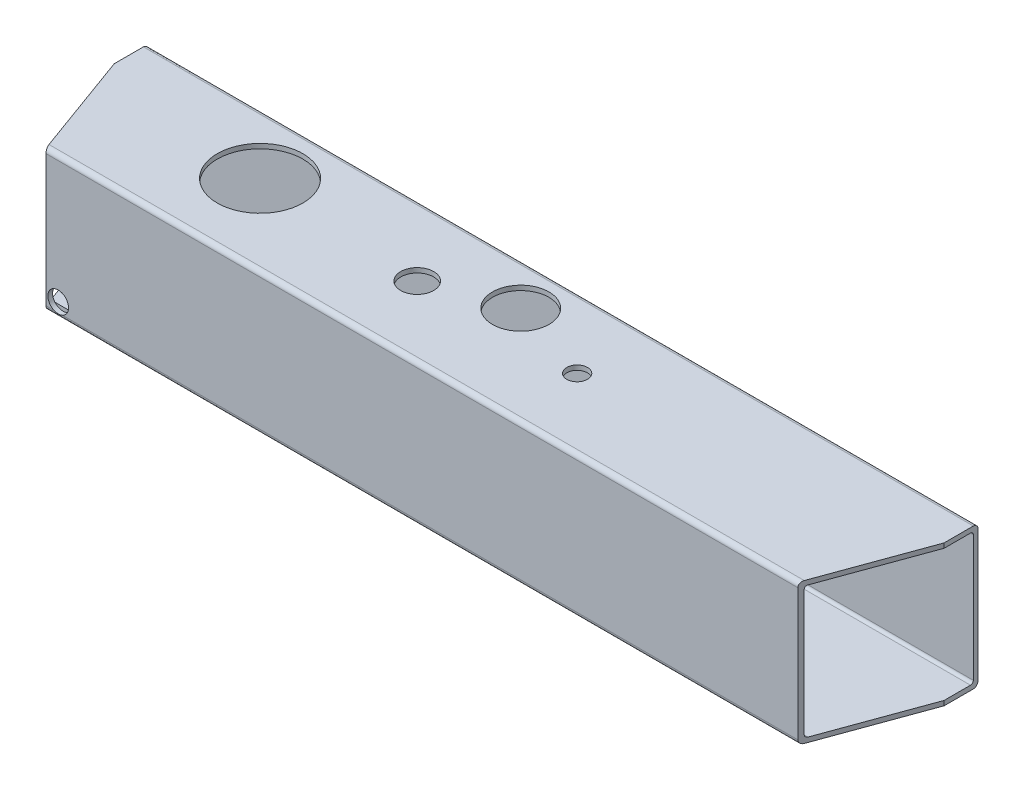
ISO-10303-21;
HEADER;
FILE_DESCRIPTION(('STEP AP214'),'2;1');
FILE_NAME('part.step','',(''),(''),'','','');
FILE_SCHEMA(('AUTOMOTIVE_DESIGN { 1 0 10303 214 1 1 1 1 }'));
ENDSEC;
DATA;
#1=APPLICATION_CONTEXT('core data for automotive mechanical design processes');
#2=APPLICATION_PROTOCOL_DEFINITION('international standard','automotive_design',2000,#1);
#3=PRODUCT_CONTEXT('',#1,'mechanical');
#4=PRODUCT('Part','Part','',(#3));
#5=PRODUCT_RELATED_PRODUCT_CATEGORY('part','',(#4));
#6=PRODUCT_DEFINITION_FORMATION('','',#4);
#7=PRODUCT_DEFINITION_CONTEXT('part definition',#1,'design');
#8=PRODUCT_DEFINITION('design','',#6,#7);
#9=PRODUCT_DEFINITION_SHAPE('','',#8);
#10=(LENGTH_UNIT() NAMED_UNIT(*) SI_UNIT(.MILLI.,.METRE.));
#11=(NAMED_UNIT(*) PLANE_ANGLE_UNIT() SI_UNIT($,.RADIAN.));
#12=(NAMED_UNIT(*) SI_UNIT($,.STERADIAN.) SOLID_ANGLE_UNIT());
#13=UNCERTAINTY_MEASURE_WITH_UNIT(LENGTH_MEASURE(1.E-05),#10,'distance_accuracy_value','');
#14=(GEOMETRIC_REPRESENTATION_CONTEXT(3) GLOBAL_UNCERTAINTY_ASSIGNED_CONTEXT((#13)) GLOBAL_UNIT_ASSIGNED_CONTEXT((#10,
#11,#12)) REPRESENTATION_CONTEXT('',''));
#15=CARTESIAN_POINT('',(0.,0.,0.));
#16=DIRECTION('',(0.,0.,1.));
#17=DIRECTION('',(1.,0.,0.));
#18=AXIS2_PLACEMENT_3D('',#15,#16,#17);
#19=CARTESIAN_POINT('',(441.,-67.,7.99999999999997));
#20=DIRECTION('',(-1.,0.,0.));
#21=DIRECTION('',(0.,0.,1.));
#22=AXIS2_PLACEMENT_3D('',#19,#20,#21);
#23=CYLINDRICAL_SURFACE('',#22,3.);
#24=CARTESIAN_POINT('',(15.1986841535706,-70.,7.99999999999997));
#25=CARTESIAN_POINT('',(14.9643266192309,-69.9999652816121,7.90372846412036));
#26=CARTESIAN_POINT('',(14.7290875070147,-69.9953674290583,7.80970354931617));
#27=CARTESIAN_POINT('',(14.2571828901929,-69.9780619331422,7.62625599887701));
#28=CARTESIAN_POINT('',(14.0205177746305,-69.9653564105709,7.53683216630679));
#29=CARTESIAN_POINT('',(13.5462759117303,-69.9328715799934,7.36275581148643));
#30=CARTESIAN_POINT('',(13.3087007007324,-69.9131012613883,7.27809738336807));
#31=CARTESIAN_POINT('',(12.832526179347,-69.8672896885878,7.11346223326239));
#32=CARTESIAN_POINT('',(12.5939267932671,-69.841247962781,7.03348586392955));
#33=CARTESIAN_POINT('',(11.878106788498,-69.7549529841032,6.80102319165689));
#34=CARTESIAN_POINT('',(11.3995845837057,-69.6864343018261,6.65553406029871));
#35=CARTESIAN_POINT('',(10.4399178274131,-69.5318907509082,6.38320208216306));
#36=CARTESIAN_POINT('',(9.95877220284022,-69.4458580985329,6.2563675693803));
#37=CARTESIAN_POINT('',(9.08628068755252,-69.2775499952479,6.043601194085));
#38=CARTESIAN_POINT('',(8.69524447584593,-69.1976671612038,5.95447673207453));
#39=CARTESIAN_POINT('',(7.91221594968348,-69.0303453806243,5.78830469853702));
#40=CARTESIAN_POINT('',(7.52022357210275,-68.9429059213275,5.7112579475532));
#41=CARTESIAN_POINT('',(6.34300548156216,-68.6713367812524,5.49807034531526));
#42=CARTESIAN_POINT('',(5.55658730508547,-68.4779660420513,5.37989393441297));
#43=CARTESIAN_POINT('',(3.98184487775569,-68.0759302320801,5.19077702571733));
#44=CARTESIAN_POINT('',(3.19352002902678,-67.8672595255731,5.1198540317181));
#45=CARTESIAN_POINT('',(1.61626316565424,-67.4425795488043,5.02486445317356));
#46=CARTESIAN_POINT('',(0.827331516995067,-67.2265732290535,5.00077925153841));
#47=CARTESIAN_POINT('',(0.025719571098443,-67.0070435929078,5.00000620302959));
#48=CARTESIAN_POINT('',(0.0128597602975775,-67.0035217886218,5.00000000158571));
#49=CARTESIAN_POINT('',(0.,-67.,4.99999999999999));
#50=B_SPLINE_CURVE_WITH_KNOTS('',3,(#24,#25,#26,#27,#28,#29,#30,#31,#32,#33,#34,#35,#36,#37,#38,
#39,#40,#41,#42,#43,#44,#45,#46,#47,#48,#49),.UNSPECIFIED.,.F.,.F.,(4,2,2,2,2,2,2,2,2,2,2,2,4),
(0.,0.759974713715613,1.51975071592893,2.27856338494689,3.03743313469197,4.55107995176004,
6.06540095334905,7.29196399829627,8.5186103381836,10.9720552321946,13.4264084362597,
15.8797858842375,15.9197858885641),.UNSPECIFIED.);
#51=CARTESIAN_POINT('',(0.,-67.,4.99999999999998));
#52=VERTEX_POINT('',#51);
#53=CARTESIAN_POINT('',(15.1986841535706,-70.,7.99999999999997));
#54=VERTEX_POINT('',#53);
#55=EDGE_CURVE('E63',#52,#54,#50,.F.);
#56=ORIENTED_EDGE('',*,*,#55,.T.);
#57=DIRECTION('',(-1.,0.,0.));
#58=VECTOR('',#57,1.);
#59=CARTESIAN_POINT('',(441.,-70.,7.99999999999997));
#60=LINE('',#59,#58);
#61=CARTESIAN_POINT('',(441.,-70.,7.99999999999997));
#62=VERTEX_POINT('',#61);
#63=EDGE_CURVE('E215',#62,#54,#60,.T.);
#64=ORIENTED_EDGE('',*,*,#63,.F.);
#65=CARTESIAN_POINT('',(441.,-67.,7.99999999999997));
#66=DIRECTION('',(1.,0.,0.));
#67=DIRECTION('',(0.,0.,-1.));
#68=AXIS2_PLACEMENT_3D('',#65,#66,#67);
#69=CIRCLE('',#68,3.);
#70=CARTESIAN_POINT('',(441.,-67.,4.99999999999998));
#71=VERTEX_POINT('',#70);
#72=EDGE_CURVE('E273',#62,#71,#69,.T.);
#73=ORIENTED_EDGE('',*,*,#72,.T.);
#74=DIRECTION('',(-1.,0.,0.));
#75=VECTOR('',#74,1.);
#76=CARTESIAN_POINT('',(441.,-67.,4.99999999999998));
#77=LINE('',#76,#75);
#78=EDGE_CURVE('E229',#71,#52,#77,.T.);
#79=ORIENTED_EDGE('',*,*,#78,.T.);
#80=EDGE_LOOP('',(#56,#64,#73,#79));
#81=FACE_BOUND('',#80,.T.);
#82=ADVANCED_FACE('F43',(#81),#23,.F.);
#83=CARTESIAN_POINT('',(441.,75.,145.));
#84=DIRECTION('',(0.,-1.,0.));
#85=DIRECTION('',(0.,0.,-1.));
#86=AXIS2_PLACEMENT_3D('',#83,#84,#85);
#87=PLANE('',#86);
#88=CARTESIAN_POINT('',(-258.,75.,64.));
#89=DIRECTION('',(0.,1.,0.));
#90=DIRECTION('',(0.,0.,1.));
#91=AXIS2_PLACEMENT_3D('',#88,#89,#90);
#92=CIRCLE('',#91,45.5);
#93=CARTESIAN_POINT('',(-258.,75.,109.5));
#94=VERTEX_POINT('',#93);
#95=EDGE_CURVE('E545',#94,#94,#92,.T.);
#96=ORIENTED_EDGE('',*,*,#95,.F.);
#97=EDGE_LOOP('',(#96));
#98=FACE_BOUND('',#97,.T.);
#99=CARTESIAN_POINT('',(-80.,75.,75.));
#100=DIRECTION('',(0.,1.,0.));
#101=DIRECTION('',(0.,0.,1.));
#102=AXIS2_PLACEMENT_3D('',#99,#100,#101);
#103=CIRCLE('',#102,17.5);
#104=CARTESIAN_POINT('',(-80.,75.,92.5));
#105=VERTEX_POINT('',#104);
#106=EDGE_CURVE('E541',#105,#105,#103,.T.);
#107=ORIENTED_EDGE('',*,*,#106,.F.);
#108=EDGE_LOOP('',(#107));
#109=FACE_BOUND('',#108,.T.);
#110=CARTESIAN_POINT('',(0.,75.,45.));
#111=DIRECTION('',(0.,1.,0.));
#112=DIRECTION('',(0.,0.,1.));
#113=AXIS2_PLACEMENT_3D('',#110,#111,#112);
#114=CIRCLE('',#113,30.);
#115=CARTESIAN_POINT('',(0.,75.,75.));
#116=VERTEX_POINT('',#115);
#117=EDGE_CURVE('E535',#116,#116,#114,.T.);
#118=ORIENTED_EDGE('',*,*,#117,.F.);
#119=EDGE_LOOP('',(#118));
#120=FACE_BOUND('',#119,.T.);
#121=DIRECTION('',(0.342020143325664,0.,-0.93969262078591));
#122=VECTOR('',#121,1.);
#123=CARTESIAN_POINT('',(441.,75.,36.));
#124=LINE('',#123,#122);
#125=CARTESIAN_POINT('',(401.327244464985,75.,145.));
#126=VERTEX_POINT('',#125);
#127=CARTESIAN_POINT('',(441.,75.,36.));
#128=VERTEX_POINT('',#127);
#129=EDGE_CURVE('E420',#126,#128,#124,.T.);
#130=ORIENTED_EDGE('',*,*,#129,.T.);
#131=DIRECTION('',(0.,0.,1.));
#132=VECTOR('',#131,1.);
#133=CARTESIAN_POINT('',(441.,75.,145.));
#134=LINE('',#133,#132);
#135=CARTESIAN_POINT('',(441.,75.,4.99999999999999));
#136=VERTEX_POINT('',#135);
#137=EDGE_CURVE('E252',#136,#128,#134,.T.);
#138=ORIENTED_EDGE('',*,*,#137,.F.);
#139=DIRECTION('',(-1.,0.,0.));
#140=VECTOR('',#139,1.);
#141=CARTESIAN_POINT('',(441.,75.,4.99999999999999));
#142=LINE('',#141,#140);
#143=CARTESIAN_POINT('',(-441.,75.,4.99999999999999));
#144=VERTEX_POINT('',#143);
#145=EDGE_CURVE('E289',#136,#144,#142,.T.);
#146=ORIENTED_EDGE('',*,*,#145,.T.);
#147=DIRECTION('',(0.,0.,1.));
#148=VECTOR('',#147,1.);
#149=CARTESIAN_POINT('',(-441.,75.,145.));
#150=LINE('',#149,#148);
#151=CARTESIAN_POINT('',(-441.,75.,36.));
#152=VERTEX_POINT('',#151);
#153=EDGE_CURVE('E262',#144,#152,#150,.T.);
#154=ORIENTED_EDGE('',*,*,#153,.T.);
#155=DIRECTION('',(-0.342020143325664,0.,-0.93969262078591));
#156=VECTOR('',#155,1.);
#157=CARTESIAN_POINT('',(-441.,75.,36.));
#158=LINE('',#157,#156);
#159=CARTESIAN_POINT('',(-401.327244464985,75.,145.));
#160=VERTEX_POINT('',#159);
#161=EDGE_CURVE('E389',#160,#152,#158,.T.);
#162=ORIENTED_EDGE('',*,*,#161,.F.);
#163=DIRECTION('',(-1.,0.,0.));
#164=VECTOR('',#163,1.);
#165=CARTESIAN_POINT('',(441.,75.,145.));
#166=LINE('',#165,#164);
#167=EDGE_CURVE('E238',#126,#160,#166,.T.);
#168=ORIENTED_EDGE('',*,*,#167,.F.);
#169=EDGE_LOOP('',(#130,#138,#146,#154,#162,#168));
#170=FACE_BOUND('',#169,.T.);
#171=CARTESIAN_POINT('',(90.,75.,75.));
#172=DIRECTION('',(0.,1.,0.));
#173=DIRECTION('',(0.,0.,1.));
#174=AXIS2_PLACEMENT_3D('',#171,#172,#173);
#175=CIRCLE('',#174,11.);
#176=CARTESIAN_POINT('',(90.,75.,86.));
#177=VERTEX_POINT('',#176);
#178=EDGE_CURVE('E532',#177,#177,#175,.T.);
#179=ORIENTED_EDGE('',*,*,#178,.F.);
#180=EDGE_LOOP('',(#179));
#181=FACE_BOUND('',#180,.T.);
#182=ADVANCED_FACE('F382',(#98,#109,#120,#170,#181),#87,.F.);
#183=CARTESIAN_POINT('',(441.,70.,150.));
#184=DIRECTION('',(0.,0.,-1.));
#185=DIRECTION('',(0.,1.,0.));
#186=AXIS2_PLACEMENT_3D('',#183,#184,#185);
#187=PLANE('',#186);
#188=CARTESIAN_POINT('',(-386.507393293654,-60.,150.));
#189=DIRECTION('',(0.,0.,1.));
#190=DIRECTION('',(0.,-1.,0.));
#191=AXIS2_PLACEMENT_3D('',#188,#189,#190);
#192=CIRCLE('',#191,11.);
#193=CARTESIAN_POINT('',(-381.924817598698,-70.,150.));
#194=VERTEX_POINT('',#193);
#195=CARTESIAN_POINT('',(-391.089968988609,-70.,150.));
#196=VERTEX_POINT('',#195);
#197=EDGE_CURVE('E401',#194,#196,#192,.T.);
#198=ORIENTED_EDGE('',*,*,#197,.F.);
#199=DIRECTION('',(-1.,0.,0.));
#200=VECTOR('',#199,1.);
#201=CARTESIAN_POINT('',(441.,-70.,150.));
#202=LINE('',#201,#200);
#203=CARTESIAN_POINT('',(399.507393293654,-70.,150.));
#204=VERTEX_POINT('',#203);
#205=EDGE_CURVE('E305',#204,#194,#202,.T.);
#206=ORIENTED_EDGE('',*,*,#205,.F.);
#207=DIRECTION('',(0.,1.,0.));
#208=VECTOR('',#207,1.);
#209=CARTESIAN_POINT('',(399.507393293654,-75.0000000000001,150.));
#210=LINE('',#209,#208);
#211=CARTESIAN_POINT('',(399.507393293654,70.,150.));
#212=VERTEX_POINT('',#211);
#213=EDGE_CURVE('E395',#204,#212,#210,.T.);
#214=ORIENTED_EDGE('',*,*,#213,.T.);
#215=DIRECTION('',(-1.,0.,0.));
#216=VECTOR('',#215,1.);
#217=CARTESIAN_POINT('',(441.,70.,150.));
#218=LINE('',#217,#216);
#219=CARTESIAN_POINT('',(-399.507393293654,70.,150.));
#220=VERTEX_POINT('',#219);
#221=EDGE_CURVE('E241',#212,#220,#218,.T.);
#222=ORIENTED_EDGE('',*,*,#221,.T.);
#223=DIRECTION('',(0.,1.,0.));
#224=VECTOR('',#223,1.);
#225=CARTESIAN_POINT('',(-399.507393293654,-75.0000000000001,150.));
#226=LINE('',#225,#224);
#227=CARTESIAN_POINT('',(-399.507393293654,-70.,150.));
#228=VERTEX_POINT('',#227);
#229=EDGE_CURVE('E425',#228,#220,#226,.T.);
#230=ORIENTED_EDGE('',*,*,#229,.F.);
#231=EDGE_CURVE('E304',#196,#228,#202,.T.);
#232=ORIENTED_EDGE('',*,*,#231,.F.);
#233=EDGE_LOOP('',(#198,#206,#214,#222,#230,#232));
#234=FACE_BOUND('',#233,.T.);
#235=ADVANCED_FACE('F423',(#234),#187,.F.);
#236=CARTESIAN_POINT('',(441.,70.,145.));
#237=DIRECTION('',(-1.,0.,0.));
#238=DIRECTION('',(0.,0.,1.));
#239=AXIS2_PLACEMENT_3D('',#236,#237,#238);
#240=CYLINDRICAL_SURFACE('',#239,5.);
#241=CARTESIAN_POINT('',(401.327244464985,70.,145.));
#242=DIRECTION('',(0.93969262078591,0.,0.342020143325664));
#243=DIRECTION('',(-0.342020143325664,0.,0.93969262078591));
#244=AXIS2_PLACEMENT_3D('',#241,#242,#243);
#245=ELLIPSE('',#244,5.32088886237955,5.);
#246=EDGE_CURVE('E435',#126,#212,#245,.T.);
#247=ORIENTED_EDGE('',*,*,#246,.F.);
#248=ORIENTED_EDGE('',*,*,#167,.T.);
#249=CARTESIAN_POINT('',(-401.327244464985,70.,145.));
#250=DIRECTION('',(0.93969262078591,0.,-0.342020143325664));
#251=DIRECTION('',(-0.342020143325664,0.,-0.93969262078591));
#252=AXIS2_PLACEMENT_3D('',#249,#250,#251);
#253=ELLIPSE('',#252,5.32088886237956,5.);
#254=EDGE_CURVE('E351',#160,#220,#253,.T.);
#255=ORIENTED_EDGE('',*,*,#254,.T.);
#256=ORIENTED_EDGE('',*,*,#221,.F.);
#257=EDGE_LOOP('',(#247,#248,#255,#256));
#258=FACE_BOUND('',#257,.T.);
#259=ADVANCED_FACE('F492',(#258),#240,.T.);
#260=CARTESIAN_POINT('',(441.,-70.,145.));
#261=DIRECTION('',(-1.,0.,0.));
#262=DIRECTION('',(0.,0.,1.));
#263=AXIS2_PLACEMENT_3D('',#260,#261,#262);
#264=CYLINDRICAL_SURFACE('',#263,4.99999999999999);
#265=ORIENTED_EDGE('',*,*,#205,.T.);
#266=CARTESIAN_POINT('',(-381.924817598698,-70.,150.));
#267=CARTESIAN_POINT('',(-382.063832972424,-70.0637070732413,149.999990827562));
#268=CARTESIAN_POINT('',(-382.204169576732,-70.1245076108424,149.998782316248));
#269=CARTESIAN_POINT('',(-382.487221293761,-70.2401942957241,149.994565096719));
#270=CARTESIAN_POINT('',(-382.629936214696,-70.2950809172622,149.991556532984));
#271=CARTESIAN_POINT('',(-382.917493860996,-70.3988454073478,149.984337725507));
#272=CARTESIAN_POINT('',(-383.062336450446,-70.4477236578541,149.980127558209));
#273=CARTESIAN_POINT('',(-383.353905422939,-70.5393963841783,149.97103287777));
#274=CARTESIAN_POINT('',(-383.50063184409,-70.5821907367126,149.966148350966));
#275=CARTESIAN_POINT('',(-383.943045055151,-70.7012760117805,149.951228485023));
#276=CARTESIAN_POINT('',(-384.241256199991,-70.7683738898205,149.940917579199));
#277=CARTESIAN_POINT('',(-384.842249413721,-70.8775271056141,149.922702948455));
#278=CARTESIAN_POINT('',(-385.145031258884,-70.9195836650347,149.914799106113));
#279=CARTESIAN_POINT('',(-385.755442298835,-70.9785825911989,149.903396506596));
#280=CARTESIAN_POINT('',(-386.063090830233,-70.9953330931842,149.899931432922));
#281=CARTESIAN_POINT('',(-386.678744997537,-71.0029736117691,149.89837302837));
#282=CARTESIAN_POINT('',(-386.986750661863,-70.9938614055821,149.90028015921));
#283=CARTESIAN_POINT('',(-387.600531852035,-70.9498679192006,149.908996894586));
#284=CARTESIAN_POINT('',(-387.906309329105,-70.9150128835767,149.915801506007));
#285=CARTESIAN_POINT('',(-388.513673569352,-70.8198585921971,149.932559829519));
#286=CARTESIAN_POINT('',(-388.815261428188,-70.7595661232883,149.94251270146));
#287=CARTESIAN_POINT('',(-389.453215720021,-70.6039654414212,149.964095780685));
#288=CARTESIAN_POINT('',(-389.788702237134,-70.5049978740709,149.975769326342));
#289=CARTESIAN_POINT('',(-390.283496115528,-70.3330309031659,149.98922406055));
#290=CARTESIAN_POINT('',(-390.446935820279,-70.271828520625,149.99303208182));
#291=CARTESIAN_POINT('',(-390.770805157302,-70.1416851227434,149.99841458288));
#292=CARTESIAN_POINT('',(-390.931233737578,-70.0727414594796,149.999988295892));
#293=CARTESIAN_POINT('',(-391.089968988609,-70.,150.));
#294=B_SPLINE_CURVE_WITH_KNOTS('',3,(#266,#267,#268,#269,#270,#271,#272,#273,#274,#275,#276,
#277,#278,#279,#280,#281,#282,#283,#284,#285,#286,#287,#288,#289,#290,#291,#292,#293),
.UNSPECIFIED.,.F.,.F.,(4,2,2,2,2,2,2,2,2,2,2,2,2,4),(0.,0.458701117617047,0.917365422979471,
1.37600055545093,1.83464498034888,2.75101013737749,3.66733058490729,4.59056410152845,
5.51387696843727,6.43624982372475,7.35837674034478,8.40652760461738,8.93004043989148,
9.45373289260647),.UNSPECIFIED.);
#295=EDGE_CURVE('E411',#194,#196,#294,.T.);
#296=ORIENTED_EDGE('',*,*,#295,.T.);
#297=ORIENTED_EDGE('',*,*,#231,.T.);
#298=CARTESIAN_POINT('',(-401.327244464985,-70.,145.));
#299=DIRECTION('',(0.93969262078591,0.,-0.342020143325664));
#300=DIRECTION('',(-0.342020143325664,0.,-0.93969262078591));
#301=AXIS2_PLACEMENT_3D('',#298,#299,#300);
#302=ELLIPSE('',#301,5.32088886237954,4.99999999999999);
#303=CARTESIAN_POINT('',(-401.327244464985,-75.0000000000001,145.));
#304=VERTEX_POINT('',#303);
#305=EDGE_CURVE('E348',#228,#304,#302,.T.);
#306=ORIENTED_EDGE('',*,*,#305,.T.);
#307=DIRECTION('',(-1.,0.,0.));
#308=VECTOR('',#307,1.);
#309=CARTESIAN_POINT('',(441.,-75.,145.));
#310=LINE('',#309,#308);
#311=CARTESIAN_POINT('',(401.327244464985,-75.0000000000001,145.));
#312=VERTEX_POINT('',#311);
#313=EDGE_CURVE('E302',#312,#304,#310,.T.);
#314=ORIENTED_EDGE('',*,*,#313,.F.);
#315=CARTESIAN_POINT('',(401.327244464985,-70.,145.));
#316=DIRECTION('',(0.93969262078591,0.,0.342020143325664));
#317=DIRECTION('',(-0.342020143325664,0.,0.93969262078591));
#318=AXIS2_PLACEMENT_3D('',#315,#316,#317);
#319=ELLIPSE('',#318,5.32088886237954,4.99999999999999);
#320=EDGE_CURVE('E437',#204,#312,#319,.T.);
#321=ORIENTED_EDGE('',*,*,#320,.F.);
#322=EDGE_LOOP('',(#265,#296,#297,#306,#314,#321));
#323=FACE_BOUND('',#322,.T.);
#324=ADVANCED_FACE('F417',(#323),#264,.T.);
#325=CARTESIAN_POINT('',(441.,-75.,145.));
#326=DIRECTION('',(0.,1.,0.));
#327=DIRECTION('',(0.,0.,1.));
#328=AXIS2_PLACEMENT_3D('',#325,#326,#327);
#329=PLANE('',#328);
#330=DIRECTION('',(-1.,0.,0.));
#331=VECTOR('',#330,1.);
#332=CARTESIAN_POINT('',(441.,-75.,4.99999999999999));
#333=LINE('',#332,#331);
#334=CARTESIAN_POINT('',(0.,-75.,4.99999999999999));
#335=VERTEX_POINT('',#334);
#336=CARTESIAN_POINT('',(-441.,-75.,4.99999999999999));
#337=VERTEX_POINT('',#336);
#338=EDGE_CURVE('E298',#335,#337,#333,.T.);
#339=ORIENTED_EDGE('',*,*,#338,.F.);
#340=CARTESIAN_POINT('',(0.,-75.,45.));
#341=DIRECTION('',(0.,-1.,0.));
#342=DIRECTION('',(0.,0.,-1.));
#343=AXIS2_PLACEMENT_3D('',#340,#341,#342);
#344=CIRCLE('',#343,40.);
#345=EDGE_CURVE('E56',#335,#335,#344,.T.);
#346=ORIENTED_EDGE('',*,*,#345,.F.);
#347=CARTESIAN_POINT('',(441.,-75.,4.99999999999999));
#348=VERTEX_POINT('',#347);
#349=EDGE_CURVE('E299',#348,#335,#333,.T.);
#350=ORIENTED_EDGE('',*,*,#349,.F.);
#351=DIRECTION('',(0.,0.,-1.));
#352=VECTOR('',#351,1.);
#353=CARTESIAN_POINT('',(441.,-75.,145.));
#354=LINE('',#353,#352);
#355=CARTESIAN_POINT('',(441.,-75.,36.));
#356=VERTEX_POINT('',#355);
#357=EDGE_CURVE('E278',#356,#348,#354,.T.);
#358=ORIENTED_EDGE('',*,*,#357,.F.);
#359=DIRECTION('',(0.342020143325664,0.,-0.93969262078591));
#360=VECTOR('',#359,1.);
#361=CARTESIAN_POINT('',(441.,-75.0000000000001,36.));
#362=LINE('',#361,#360);
#363=EDGE_CURVE('E447',#312,#356,#362,.T.);
#364=ORIENTED_EDGE('',*,*,#363,.F.);
#365=ORIENTED_EDGE('',*,*,#313,.T.);
#366=DIRECTION('',(-0.342020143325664,0.,-0.93969262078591));
#367=VECTOR('',#366,1.);
#368=CARTESIAN_POINT('',(-441.,-75.,36.));
#369=LINE('',#368,#367);
#370=CARTESIAN_POINT('',(-441.,-75.,36.));
#371=VERTEX_POINT('',#370);
#372=EDGE_CURVE('E428',#304,#371,#369,.T.);
#373=ORIENTED_EDGE('',*,*,#372,.T.);
#374=DIRECTION('',(0.,0.,-1.));
#375=VECTOR('',#374,1.);
#376=CARTESIAN_POINT('',(-441.,-75.,145.));
#377=LINE('',#376,#375);
#378=EDGE_CURVE('E366',#371,#337,#377,.T.);
#379=ORIENTED_EDGE('',*,*,#378,.T.);
#380=EDGE_LOOP('',(#339,#346,#350,#358,#364,#365,#373,#379));
#381=FACE_BOUND('',#380,.T.);
#382=ADVANCED_FACE('F485',(#381),#329,.F.);
#383=CARTESIAN_POINT('',(441.,67.,142.));
#384=DIRECTION('',(-1.,0.,0.));
#385=DIRECTION('',(0.,0.,1.));
#386=AXIS2_PLACEMENT_3D('',#383,#384,#385);
#387=CYLINDRICAL_SURFACE('',#386,3.00000000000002);
#388=DIRECTION('',(-1.,0.,0.));
#389=VECTOR('',#388,1.);
#390=CARTESIAN_POINT('',(441.,70.,142.));
#391=LINE('',#390,#389);
#392=CARTESIAN_POINT('',(402.419155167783,70.,142.));
#393=VERTEX_POINT('',#392);
#394=CARTESIAN_POINT('',(-402.419155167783,70.,142.));
#395=VERTEX_POINT('',#394);
#396=EDGE_CURVE('E236',#393,#395,#391,.T.);
#397=ORIENTED_EDGE('',*,*,#396,.F.);
#398=CARTESIAN_POINT('',(402.419155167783,67.,142.));
#399=DIRECTION('',(0.93969262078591,0.,0.342020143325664));
#400=DIRECTION('',(-0.342020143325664,0.,0.93969262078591));
#401=AXIS2_PLACEMENT_3D('',#398,#399,#400);
#402=ELLIPSE('',#401,3.19253331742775,3.00000000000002);
#403=CARTESIAN_POINT('',(401.327244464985,67.,145.));
#404=VERTEX_POINT('',#403);
#405=EDGE_CURVE('E392',#393,#404,#402,.T.);
#406=ORIENTED_EDGE('',*,*,#405,.T.);
#407=DIRECTION('',(-1.,0.,0.));
#408=VECTOR('',#407,1.);
#409=CARTESIAN_POINT('',(441.,67.,145.));
#410=LINE('',#409,#408);
#411=CARTESIAN_POINT('',(-401.327244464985,67.,145.));
#412=VERTEX_POINT('',#411);
#413=EDGE_CURVE('E287',#404,#412,#410,.T.);
#414=ORIENTED_EDGE('',*,*,#413,.T.);
#415=CARTESIAN_POINT('',(-402.419155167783,67.,142.));
#416=DIRECTION('',(0.93969262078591,0.,-0.342020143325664));
#417=DIRECTION('',(-0.342020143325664,0.,-0.93969262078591));
#418=AXIS2_PLACEMENT_3D('',#415,#416,#417);
#419=ELLIPSE('',#418,3.19253331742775,3.00000000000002);
#420=EDGE_CURVE('E334',#395,#412,#419,.T.);
#421=ORIENTED_EDGE('',*,*,#420,.F.);
#422=EDGE_LOOP('',(#397,#406,#414,#421));
#423=FACE_BOUND('',#422,.T.);
#424=ADVANCED_FACE('F45',(#423),#387,.F.);
#425=CARTESIAN_POINT('',(441.,70.,7.99999999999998));
#426=DIRECTION('',(0.,-1.,0.));
#427=DIRECTION('',(0.,0.,-1.));
#428=AXIS2_PLACEMENT_3D('',#425,#426,#427);
#429=PLANE('',#428);
#430=CARTESIAN_POINT('',(-258.,70.,64.));
#431=DIRECTION('',(0.,-1.,0.));
#432=DIRECTION('',(0.,0.,-1.));
#433=AXIS2_PLACEMENT_3D('',#430,#431,#432);
#434=CIRCLE('',#433,45.5);
#435=CARTESIAN_POINT('',(-258.,70.,18.5));
#436=VERTEX_POINT('',#435);
#437=EDGE_CURVE('E216',#436,#436,#434,.F.);
#438=ORIENTED_EDGE('',*,*,#437,.T.);
#439=EDGE_LOOP('',(#438));
#440=FACE_BOUND('',#439,.T.);
#441=CARTESIAN_POINT('',(-80.,70.,75.));
#442=DIRECTION('',(0.,-1.,0.));
#443=DIRECTION('',(0.,0.,-1.));
#444=AXIS2_PLACEMENT_3D('',#441,#442,#443);
#445=CIRCLE('',#444,17.5);
#446=CARTESIAN_POINT('',(-80.,70.,57.5));
#447=VERTEX_POINT('',#446);
#448=EDGE_CURVE('E524',#447,#447,#445,.F.);
#449=ORIENTED_EDGE('',*,*,#448,.T.);
#450=EDGE_LOOP('',(#449));
#451=FACE_BOUND('',#450,.T.);
#452=CARTESIAN_POINT('',(0.,70.,45.));
#453=DIRECTION('',(0.,-1.,0.));
#454=DIRECTION('',(0.,0.,-1.));
#455=AXIS2_PLACEMENT_3D('',#452,#453,#454);
#456=CIRCLE('',#455,30.);
#457=CARTESIAN_POINT('',(0.,70.,15.));
#458=VERTEX_POINT('',#457);
#459=EDGE_CURVE('E528',#458,#458,#456,.F.);
#460=ORIENTED_EDGE('',*,*,#459,.T.);
#461=EDGE_LOOP('',(#460));
#462=FACE_BOUND('',#461,.T.);
#463=CARTESIAN_POINT('',(90.,70.,75.));
#464=DIRECTION('',(0.,-1.,0.));
#465=DIRECTION('',(0.,0.,-1.));
#466=AXIS2_PLACEMENT_3D('',#463,#464,#465);
#467=CIRCLE('',#466,11.);
#468=CARTESIAN_POINT('',(90.,70.,64.));
#469=VERTEX_POINT('',#468);
#470=EDGE_CURVE('E402',#469,#469,#467,.T.);
#471=ORIENTED_EDGE('',*,*,#470,.F.);
#472=EDGE_LOOP('',(#471));
#473=FACE_BOUND('',#472,.T.);
#474=DIRECTION('',(0.,0.,1.));
#475=VECTOR('',#474,1.);
#476=CARTESIAN_POINT('',(441.,70.,7.99999999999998));
#477=LINE('',#476,#475);
#478=CARTESIAN_POINT('',(441.,70.,7.99999999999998));
#479=VERTEX_POINT('',#478);
#480=CARTESIAN_POINT('',(441.,70.,36.));
#481=VERTEX_POINT('',#480);
#482=EDGE_CURVE('E249',#479,#481,#477,.T.);
#483=ORIENTED_EDGE('',*,*,#482,.T.);
#484=DIRECTION('',(-0.342020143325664,0.,0.93969262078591));
#485=VECTOR('',#484,1.);
#486=CARTESIAN_POINT('',(449.999026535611,70.,11.2753777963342));
#487=LINE('',#486,#485);
#488=EDGE_CURVE('E258',#481,#393,#487,.T.);
#489=ORIENTED_EDGE('',*,*,#488,.T.);
#490=ORIENTED_EDGE('',*,*,#396,.T.);
#491=DIRECTION('',(0.342020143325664,0.,0.93969262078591));
#492=VECTOR('',#491,1.);
#493=CARTESIAN_POINT('',(-346.824625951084,70.,294.744713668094));
#494=LINE('',#493,#492);
#495=CARTESIAN_POINT('',(-441.,70.,36.));
#496=VERTEX_POINT('',#495);
#497=EDGE_CURVE('E346',#496,#395,#494,.T.);
#498=ORIENTED_EDGE('',*,*,#497,.F.);
#499=DIRECTION('',(0.,0.,1.));
#500=VECTOR('',#499,1.);
#501=CARTESIAN_POINT('',(-441.,70.,7.99999999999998));
#502=LINE('',#501,#500);
#503=CARTESIAN_POINT('',(-441.,70.,7.99999999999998));
#504=VERTEX_POINT('',#503);
#505=EDGE_CURVE('E354',#504,#496,#502,.T.);
#506=ORIENTED_EDGE('',*,*,#505,.F.);
#507=DIRECTION('',(-1.,0.,0.));
#508=VECTOR('',#507,1.);
#509=CARTESIAN_POINT('',(441.,70.,7.99999999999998));
#510=LINE('',#509,#508);
#511=EDGE_CURVE('E234',#479,#504,#510,.T.);
#512=ORIENTED_EDGE('',*,*,#511,.F.);
#513=EDGE_LOOP('',(#483,#489,#490,#498,#506,#512));
#514=FACE_BOUND('',#513,.T.);
#515=ADVANCED_FACE('F257',(#440,#451,#462,#473,#514),#429,.T.);
#516=CARTESIAN_POINT('',(441.,-70.,142.));
#517=DIRECTION('',(0.,1.,0.));
#518=DIRECTION('',(0.,0.,1.));
#519=AXIS2_PLACEMENT_3D('',#516,#517,#518);
#520=PLANE('',#519);
#521=CARTESIAN_POINT('',(0.,-70.,45.));
#522=DIRECTION('',(0.,1.,0.));
#523=DIRECTION('',(0.,0.,1.));
#524=AXIS2_PLACEMENT_3D('',#521,#522,#523);
#525=CIRCLE('',#524,40.);
#526=CARTESIAN_POINT('',(-15.1986841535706,-70.,7.99999999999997));
#527=VERTEX_POINT('',#526);
#528=EDGE_CURVE('E203',#54,#527,#525,.F.);
#529=ORIENTED_EDGE('',*,*,#528,.T.);
#530=CARTESIAN_POINT('',(-441.,-70.,7.99999999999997));
#531=VERTEX_POINT('',#530);
#532=EDGE_CURVE('E212',#527,#531,#60,.T.);
#533=ORIENTED_EDGE('',*,*,#532,.T.);
#534=DIRECTION('',(0.,0.,-1.));
#535=VECTOR('',#534,1.);
#536=CARTESIAN_POINT('',(-441.,-70.,142.));
#537=LINE('',#536,#535);
#538=CARTESIAN_POINT('',(-441.,-70.,36.));
#539=VERTEX_POINT('',#538);
#540=EDGE_CURVE('E364',#539,#531,#537,.T.);
#541=ORIENTED_EDGE('',*,*,#540,.F.);
#542=DIRECTION('',(-0.342020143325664,0.,-0.93969262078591));
#543=VECTOR('',#542,1.);
#544=CARTESIAN_POINT('',(-303.757856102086,-70.,413.069691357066));
#545=LINE('',#544,#543);
#546=CARTESIAN_POINT('',(-402.419155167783,-70.,142.));
#547=VERTEX_POINT('',#546);
#548=EDGE_CURVE('E340',#547,#539,#545,.T.);
#549=ORIENTED_EDGE('',*,*,#548,.F.);
#550=DIRECTION('',(-1.,0.,0.));
#551=VECTOR('',#550,1.);
#552=CARTESIAN_POINT('',(441.,-70.,142.));
#553=LINE('',#552,#551);
#554=CARTESIAN_POINT('',(402.419155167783,-70.,142.));
#555=VERTEX_POINT('',#554);
#556=EDGE_CURVE('E222',#555,#547,#553,.T.);
#557=ORIENTED_EDGE('',*,*,#556,.F.);
#558=DIRECTION('',(0.342020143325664,0.,-0.93969262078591));
#559=VECTOR('',#558,1.);
#560=CARTESIAN_POINT('',(406.932256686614,-70.,129.600355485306));
#561=LINE('',#560,#559);
#562=CARTESIAN_POINT('',(441.,-70.,36.));
#563=VERTEX_POINT('',#562);
#564=EDGE_CURVE('E441',#555,#563,#561,.T.);
#565=ORIENTED_EDGE('',*,*,#564,.T.);
#566=DIRECTION('',(0.,0.,-1.));
#567=VECTOR('',#566,1.);
#568=CARTESIAN_POINT('',(441.,-70.,142.));
#569=LINE('',#568,#567);
#570=EDGE_CURVE('E276',#563,#62,#569,.T.);
#571=ORIENTED_EDGE('',*,*,#570,.T.);
#572=ORIENTED_EDGE('',*,*,#63,.T.);
#573=EDGE_LOOP('',(#529,#533,#541,#549,#557,#565,#571,#572));
#574=FACE_BOUND('',#573,.T.);
#575=ADVANCED_FACE('F210',(#574),#520,.T.);
#576=CARTESIAN_POINT('',(441.,-67.,142.));
#577=DIRECTION('',(-1.,0.,0.));
#578=DIRECTION('',(0.,0.,1.));
#579=AXIS2_PLACEMENT_3D('',#576,#577,#578);
#580=CYLINDRICAL_SURFACE('',#579,3.00000000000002);
#581=DIRECTION('',(-1.,0.,0.));
#582=VECTOR('',#581,1.);
#583=CARTESIAN_POINT('',(441.,-67.,145.));
#584=LINE('',#583,#582);
#585=CARTESIAN_POINT('',(401.327244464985,-67.,145.));
#586=VERTEX_POINT('',#585);
#587=CARTESIAN_POINT('',(-378.022111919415,-67.,145.));
#588=VERTEX_POINT('',#587);
#589=EDGE_CURVE('E225',#586,#588,#584,.T.);
#590=ORIENTED_EDGE('',*,*,#589,.F.);
#591=CARTESIAN_POINT('',(402.419155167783,-67.,142.));
#592=DIRECTION('',(0.93969262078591,0.,0.342020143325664));
#593=DIRECTION('',(-0.342020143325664,0.,0.93969262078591));
#594=AXIS2_PLACEMENT_3D('',#591,#592,#593);
#595=ELLIPSE('',#594,3.19253331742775,3.00000000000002);
#596=EDGE_CURVE('E394',#586,#555,#595,.T.);
#597=ORIENTED_EDGE('',*,*,#596,.T.);
#598=ORIENTED_EDGE('',*,*,#556,.T.);
#599=CARTESIAN_POINT('',(-402.419155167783,-67.,142.));
#600=DIRECTION('',(0.93969262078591,0.,-0.342020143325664));
#601=DIRECTION('',(-0.342020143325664,0.,-0.93969262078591));
#602=AXIS2_PLACEMENT_3D('',#599,#600,#601);
#603=ELLIPSE('',#602,3.19253331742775,3.00000000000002);
#604=CARTESIAN_POINT('',(-401.327244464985,-67.,145.));
#605=VERTEX_POINT('',#604);
#606=EDGE_CURVE('E330',#605,#547,#603,.T.);
#607=ORIENTED_EDGE('',*,*,#606,.F.);
#608=CARTESIAN_POINT('',(-394.992674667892,-67.,145.));
#609=VERTEX_POINT('',#608);
#610=EDGE_CURVE('E309',#609,#605,#584,.T.);
#611=ORIENTED_EDGE('',*,*,#610,.F.);
#612=EDGE_CURVE('E311',#588,#609,#584,.T.);
#613=ORIENTED_EDGE('',*,*,#612,.F.);
#614=EDGE_LOOP('',(#590,#597,#598,#607,#611,#613));
#615=FACE_BOUND('',#614,.T.);
#616=ADVANCED_FACE('F337',(#615),#580,.F.);
#617=CARTESIAN_POINT('',(441.,67.,145.));
#618=DIRECTION('',(0.,0.,-1.));
#619=DIRECTION('',(-1.,0.,0.));
#620=AXIS2_PLACEMENT_3D('',#617,#618,#619);
#621=PLANE('',#620);
#622=CARTESIAN_POINT('',(-386.507393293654,-60.,145.));
#623=DIRECTION('',(0.,0.,-1.));
#624=DIRECTION('',(-1.,0.,0.));
#625=AXIS2_PLACEMENT_3D('',#622,#623,#624);
#626=CIRCLE('',#625,11.);
#627=EDGE_CURVE('E12',#609,#588,#626,.T.);
#628=ORIENTED_EDGE('',*,*,#627,.F.);
#629=ORIENTED_EDGE('',*,*,#610,.T.);
#630=DIRECTION('',(0.,-1.,0.));
#631=VECTOR('',#630,1.);
#632=CARTESIAN_POINT('',(-401.327244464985,66.9999999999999,145.));
#633=LINE('',#632,#631);
#634=EDGE_CURVE('E322',#412,#605,#633,.T.);
#635=ORIENTED_EDGE('',*,*,#634,.F.);
#636=ORIENTED_EDGE('',*,*,#413,.F.);
#637=DIRECTION('',(0.,-1.,0.));
#638=VECTOR('',#637,1.);
#639=CARTESIAN_POINT('',(401.327244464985,67.,145.));
#640=LINE('',#639,#638);
#641=EDGE_CURVE('E393',#404,#586,#640,.T.);
#642=ORIENTED_EDGE('',*,*,#641,.T.);
#643=ORIENTED_EDGE('',*,*,#589,.T.);
#644=EDGE_LOOP('',(#628,#629,#635,#636,#642,#643));
#645=FACE_BOUND('',#644,.T.);
#646=ADVANCED_FACE('F320',(#645),#621,.T.);
#647=CARTESIAN_POINT('',(441.,70.,145.));
#648=DIRECTION('',(1.,0.,0.));
#649=DIRECTION('',(0.,0.,-1.));
#650=AXIS2_PLACEMENT_3D('',#647,#648,#649);
#651=PLANE('',#650);
#652=ORIENTED_EDGE('',*,*,#137,.T.);
#653=DIRECTION('',(0.,-1.,0.));
#654=VECTOR('',#653,1.);
#655=CARTESIAN_POINT('',(441.,70.,36.));
#656=LINE('',#655,#654);
#657=EDGE_CURVE('E51',#128,#481,#656,.T.);
#658=ORIENTED_EDGE('',*,*,#657,.T.);
#659=ORIENTED_EDGE('',*,*,#482,.F.);
#660=CARTESIAN_POINT('',(441.,67.,7.99999999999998));
#661=DIRECTION('',(1.,0.,0.));
#662=DIRECTION('',(0.,0.,-1.));
#663=AXIS2_PLACEMENT_3D('',#660,#661,#662);
#664=CIRCLE('',#663,3.);
#665=CARTESIAN_POINT('',(441.,67.,4.99999999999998));
#666=VERTEX_POINT('',#665);
#667=EDGE_CURVE('E261',#666,#479,#664,.T.);
#668=ORIENTED_EDGE('',*,*,#667,.F.);
#669=DIRECTION('',(0.,1.,0.));
#670=VECTOR('',#669,1.);
#671=CARTESIAN_POINT('',(441.,-67.,4.99999999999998));
#672=LINE('',#671,#670);
#673=EDGE_CURVE('E264',#71,#666,#672,.T.);
#674=ORIENTED_EDGE('',*,*,#673,.F.);
#675=ORIENTED_EDGE('',*,*,#72,.F.);
#676=ORIENTED_EDGE('',*,*,#570,.F.);
#677=DIRECTION('',(0.,1.,0.));
#678=VECTOR('',#677,1.);
#679=CARTESIAN_POINT('',(441.,-75.0000000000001,36.));
#680=LINE('',#679,#678);
#681=EDGE_CURVE('E445',#356,#563,#680,.T.);
#682=ORIENTED_EDGE('',*,*,#681,.F.);
#683=ORIENTED_EDGE('',*,*,#357,.T.);
#684=CARTESIAN_POINT('',(441.,-70.,4.99999999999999));
#685=DIRECTION('',(1.,0.,0.));
#686=DIRECTION('',(0.,0.,-1.));
#687=AXIS2_PLACEMENT_3D('',#684,#685,#686);
#688=CIRCLE('',#687,5.);
#689=CARTESIAN_POINT('',(441.,-70.,0.));
#690=VERTEX_POINT('',#689);
#691=EDGE_CURVE('E280',#348,#690,#688,.T.);
#692=ORIENTED_EDGE('',*,*,#691,.T.);
#693=DIRECTION('',(0.,1.,0.));
#694=VECTOR('',#693,1.);
#695=CARTESIAN_POINT('',(441.,70.,0.));
#696=LINE('',#695,#694);
#697=CARTESIAN_POINT('',(441.,70.,0.));
#698=VERTEX_POINT('',#697);
#699=EDGE_CURVE('E282',#690,#698,#696,.T.);
#700=ORIENTED_EDGE('',*,*,#699,.T.);
#701=CARTESIAN_POINT('',(441.,70.,4.99999999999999));
#702=DIRECTION('',(1.,0.,0.));
#703=DIRECTION('',(0.,0.,-1.));
#704=AXIS2_PLACEMENT_3D('',#701,#702,#703);
#705=CIRCLE('',#704,5.);
#706=EDGE_CURVE('E284',#698,#136,#705,.T.);
#707=ORIENTED_EDGE('',*,*,#706,.T.);
#708=EDGE_LOOP('',(#652,#658,#659,#668,#674,#675,#676,#682,#683,#692,#700,#707));
#709=FACE_BOUND('',#708,.T.);
#710=ADVANCED_FACE('F247',(#709),#651,.T.);
#711=CARTESIAN_POINT('',(441.,-70.,4.99999999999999));
#712=DIRECTION('',(-1.,0.,0.));
#713=DIRECTION('',(0.,0.,1.));
#714=AXIS2_PLACEMENT_3D('',#711,#712,#713);
#715=CYLINDRICAL_SURFACE('',#714,5.);
#716=CARTESIAN_POINT('',(-441.,-70.,4.99999999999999));
#717=DIRECTION('',(1.,0.,0.));
#718=DIRECTION('',(0.,0.,-1.));
#719=AXIS2_PLACEMENT_3D('',#716,#717,#718);
#720=CIRCLE('',#719,5.);
#721=CARTESIAN_POINT('',(-441.,-70.,0.));
#722=VERTEX_POINT('',#721);
#723=EDGE_CURVE('E369',#337,#722,#720,.T.);
#724=ORIENTED_EDGE('',*,*,#723,.T.);
#725=DIRECTION('',(-1.,0.,0.));
#726=VECTOR('',#725,1.);
#727=CARTESIAN_POINT('',(441.,-70.,0.));
#728=LINE('',#727,#726);
#729=EDGE_CURVE('E295',#690,#722,#728,.T.);
#730=ORIENTED_EDGE('',*,*,#729,.F.);
#731=ORIENTED_EDGE('',*,*,#691,.F.);
#732=ORIENTED_EDGE('',*,*,#349,.T.);
#733=ORIENTED_EDGE('',*,*,#338,.T.);
#734=EDGE_LOOP('',(#724,#730,#731,#732,#733));
#735=FACE_BOUND('',#734,.T.);
#736=ADVANCED_FACE('F472',(#735),#715,.T.);
#737=CARTESIAN_POINT('',(441.,70.,0.));
#738=DIRECTION('',(0.,0.,1.));
#739=DIRECTION('',(1.,0.,0.));
#740=AXIS2_PLACEMENT_3D('',#737,#738,#739);
#741=PLANE('',#740);
#742=DIRECTION('',(0.,1.,0.));
#743=VECTOR('',#742,1.);
#744=CARTESIAN_POINT('',(-441.,70.,0.));
#745=LINE('',#744,#743);
#746=CARTESIAN_POINT('',(-441.,70.,0.));
#747=VERTEX_POINT('',#746);
#748=EDGE_CURVE('E371',#722,#747,#745,.T.);
#749=ORIENTED_EDGE('',*,*,#748,.T.);
#750=DIRECTION('',(-1.,0.,0.));
#751=VECTOR('',#750,1.);
#752=CARTESIAN_POINT('',(441.,70.,0.));
#753=LINE('',#752,#751);
#754=EDGE_CURVE('E292',#698,#747,#753,.T.);
#755=ORIENTED_EDGE('',*,*,#754,.F.);
#756=ORIENTED_EDGE('',*,*,#699,.F.);
#757=ORIENTED_EDGE('',*,*,#729,.T.);
#758=EDGE_LOOP('',(#749,#755,#756,#757));
#759=FACE_BOUND('',#758,.T.);
#760=ADVANCED_FACE('F479',(#759),#741,.F.);
#761=CARTESIAN_POINT('',(441.,70.,4.99999999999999));
#762=DIRECTION('',(-1.,0.,0.));
#763=DIRECTION('',(0.,0.,1.));
#764=AXIS2_PLACEMENT_3D('',#761,#762,#763);
#765=CYLINDRICAL_SURFACE('',#764,5.);
#766=CARTESIAN_POINT('',(-441.,70.,4.99999999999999));
#767=DIRECTION('',(1.,0.,0.));
#768=DIRECTION('',(0.,0.,-1.));
#769=AXIS2_PLACEMENT_3D('',#766,#767,#768);
#770=CIRCLE('',#769,5.);
#771=EDGE_CURVE('E267',#747,#144,#770,.T.);
#772=ORIENTED_EDGE('',*,*,#771,.T.);
#773=ORIENTED_EDGE('',*,*,#145,.F.);
#774=ORIENTED_EDGE('',*,*,#706,.F.);
#775=ORIENTED_EDGE('',*,*,#754,.T.);
#776=EDGE_LOOP('',(#772,#773,#774,#775));
#777=FACE_BOUND('',#776,.T.);
#778=ADVANCED_FACE('F375',(#777),#765,.T.);
#779=CARTESIAN_POINT('',(441.,67.,7.99999999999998));
#780=DIRECTION('',(-1.,0.,0.));
#781=DIRECTION('',(0.,0.,1.));
#782=AXIS2_PLACEMENT_3D('',#779,#780,#781);
#783=CYLINDRICAL_SURFACE('',#782,3.);
#784=CARTESIAN_POINT('',(-441.,67.,7.99999999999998));
#785=DIRECTION('',(1.,0.,0.));
#786=DIRECTION('',(0.,0.,-1.));
#787=AXIS2_PLACEMENT_3D('',#784,#785,#786);
#788=CIRCLE('',#787,3.);
#789=CARTESIAN_POINT('',(-441.,67.,4.99999999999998));
#790=VERTEX_POINT('',#789);
#791=EDGE_CURVE('E357',#790,#504,#788,.T.);
#792=ORIENTED_EDGE('',*,*,#791,.F.);
#793=DIRECTION('',(-1.,0.,0.));
#794=VECTOR('',#793,1.);
#795=CARTESIAN_POINT('',(441.,67.,4.99999999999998));
#796=LINE('',#795,#794);
#797=EDGE_CURVE('E232',#666,#790,#796,.T.);
#798=ORIENTED_EDGE('',*,*,#797,.F.);
#799=ORIENTED_EDGE('',*,*,#667,.T.);
#800=ORIENTED_EDGE('',*,*,#511,.T.);
#801=EDGE_LOOP('',(#792,#798,#799,#800));
#802=FACE_BOUND('',#801,.T.);
#803=ADVANCED_FACE('F478',(#802),#783,.F.);
#804=CARTESIAN_POINT('',(441.,-67.,4.99999999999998));
#805=DIRECTION('',(0.,0.,1.));
#806=DIRECTION('',(0.,-1.,0.));
#807=AXIS2_PLACEMENT_3D('',#804,#805,#806);
#808=PLANE('',#807);
#809=DIRECTION('',(0.,1.,0.));
#810=VECTOR('',#809,1.);
#811=CARTESIAN_POINT('',(-441.,-67.,4.99999999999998));
#812=LINE('',#811,#810);
#813=CARTESIAN_POINT('',(-441.,-67.,4.99999999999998));
#814=VERTEX_POINT('',#813);
#815=EDGE_CURVE('E360',#814,#790,#812,.T.);
#816=ORIENTED_EDGE('',*,*,#815,.F.);
#817=EDGE_CURVE('E224',#52,#814,#77,.T.);
#818=ORIENTED_EDGE('',*,*,#817,.F.);
#819=ORIENTED_EDGE('',*,*,#78,.F.);
#820=ORIENTED_EDGE('',*,*,#673,.T.);
#821=ORIENTED_EDGE('',*,*,#797,.T.);
#822=EDGE_LOOP('',(#816,#818,#819,#820,#821));
#823=FACE_BOUND('',#822,.T.);
#824=ADVANCED_FACE('F502',(#823),#808,.T.);
#825=CARTESIAN_POINT('',(-15.1986841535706,-70.,7.99999999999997));
#826=CARTESIAN_POINT('',(-14.9643266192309,-69.9999652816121,7.90372846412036));
#827=CARTESIAN_POINT('',(-14.7290875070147,-69.9953674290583,7.80970354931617));
#828=CARTESIAN_POINT('',(-14.2571828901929,-69.9780619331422,7.62625599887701));
#829=CARTESIAN_POINT('',(-14.0205177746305,-69.9653564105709,7.53683216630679));
#830=CARTESIAN_POINT('',(-13.5462759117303,-69.9328715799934,7.36275581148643));
#831=CARTESIAN_POINT('',(-13.3087007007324,-69.9131012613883,7.27809738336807));
#832=CARTESIAN_POINT('',(-12.832526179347,-69.8672896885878,7.11346223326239));
#833=CARTESIAN_POINT('',(-12.5939267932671,-69.841247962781,7.03348586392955));
#834=CARTESIAN_POINT('',(-11.878106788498,-69.7549529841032,6.80102319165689));
#835=CARTESIAN_POINT('',(-11.3995845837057,-69.6864343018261,6.65553406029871));
#836=CARTESIAN_POINT('',(-10.4399178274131,-69.5318907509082,6.38320208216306));
#837=CARTESIAN_POINT('',(-9.95877220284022,-69.4458580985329,6.2563675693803));
#838=CARTESIAN_POINT('',(-9.08628068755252,-69.2775499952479,6.043601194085));
#839=CARTESIAN_POINT('',(-8.69524447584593,-69.1976671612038,5.95447673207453));
#840=CARTESIAN_POINT('',(-7.91221594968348,-69.0303453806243,5.78830469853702));
#841=CARTESIAN_POINT('',(-7.52022357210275,-68.9429059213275,5.7112579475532));
#842=CARTESIAN_POINT('',(-6.34300548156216,-68.6713367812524,5.49807034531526));
#843=CARTESIAN_POINT('',(-5.55658730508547,-68.4779660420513,5.37989393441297));
#844=CARTESIAN_POINT('',(-3.98184487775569,-68.0759302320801,5.19077702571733));
#845=CARTESIAN_POINT('',(-3.19352002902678,-67.8672595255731,5.1198540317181));
#846=CARTESIAN_POINT('',(-1.61626316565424,-67.4425795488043,5.02486445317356));
#847=CARTESIAN_POINT('',(-0.827331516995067,-67.2265732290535,5.00077925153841));
#848=CARTESIAN_POINT('',(-0.025719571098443,-67.0070435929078,5.00000620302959));
#849=CARTESIAN_POINT('',(-0.0128597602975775,-67.0035217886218,5.00000000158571));
#850=CARTESIAN_POINT('',(0.,-67.,4.99999999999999));
#851=B_SPLINE_CURVE_WITH_KNOTS('',3,(#825,#826,#827,#828,#829,#830,#831,#832,#833,#834,#835,
#836,#837,#838,#839,#840,#841,#842,#843,#844,#845,#846,#847,#848,#849,#850),.UNSPECIFIED.,.F.,
.F.,(4,2,2,2,2,2,2,2,2,2,2,2,4),(0.,0.759974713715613,1.51975071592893,2.27856338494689,
3.03743313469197,4.55107995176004,6.06540095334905,7.29196399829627,8.5186103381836,
10.9720552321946,13.4264084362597,15.8797858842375,15.9197858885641),.UNSPECIFIED.);
#852=EDGE_CURVE('E200',#527,#52,#851,.T.);
#853=ORIENTED_EDGE('',*,*,#852,.T.);
#854=ORIENTED_EDGE('',*,*,#817,.T.);
#855=CARTESIAN_POINT('',(-441.,-67.,7.99999999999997));
#856=DIRECTION('',(1.,0.,0.));
#857=DIRECTION('',(0.,0.,-1.));
#858=AXIS2_PLACEMENT_3D('',#855,#856,#857);
#859=CIRCLE('',#858,3.);
#860=EDGE_CURVE('E221',#531,#814,#859,.T.);
#861=ORIENTED_EDGE('',*,*,#860,.F.);
#862=ORIENTED_EDGE('',*,*,#532,.F.);
#863=EDGE_LOOP('',(#853,#854,#861,#862));
#864=FACE_BOUND('',#863,.T.);
#865=ADVANCED_FACE('F219',(#864),#23,.F.);
#866=CARTESIAN_POINT('',(-441.,70.,145.));
#867=DIRECTION('',(1.,0.,0.));
#868=DIRECTION('',(0.,0.,-1.));
#869=AXIS2_PLACEMENT_3D('',#866,#867,#868);
#870=PLANE('',#869);
#871=ORIENTED_EDGE('',*,*,#378,.F.);
#872=DIRECTION('',(0.,1.,0.));
#873=VECTOR('',#872,1.);
#874=CARTESIAN_POINT('',(-441.,-75.,36.));
#875=LINE('',#874,#873);
#876=EDGE_CURVE('E335',#371,#539,#875,.T.);
#877=ORIENTED_EDGE('',*,*,#876,.T.);
#878=ORIENTED_EDGE('',*,*,#540,.T.);
#879=ORIENTED_EDGE('',*,*,#860,.T.);
#880=ORIENTED_EDGE('',*,*,#815,.T.);
#881=ORIENTED_EDGE('',*,*,#791,.T.);
#882=ORIENTED_EDGE('',*,*,#505,.T.);
#883=DIRECTION('',(0.,1.,0.));
#884=VECTOR('',#883,1.);
#885=CARTESIAN_POINT('',(-441.,70.,36.));
#886=LINE('',#885,#884);
#887=EDGE_CURVE('E239',#496,#152,#886,.T.);
#888=ORIENTED_EDGE('',*,*,#887,.T.);
#889=ORIENTED_EDGE('',*,*,#153,.F.);
#890=ORIENTED_EDGE('',*,*,#771,.F.);
#891=ORIENTED_EDGE('',*,*,#748,.F.);
#892=ORIENTED_EDGE('',*,*,#723,.F.);
#893=EDGE_LOOP('',(#871,#877,#878,#879,#880,#881,#882,#888,#889,#890,#891,#892));
#894=FACE_BOUND('',#893,.T.);
#895=ADVANCED_FACE('F386',(#894),#870,.F.);
#896=CARTESIAN_POINT('',(-441.,-75.,36.));
#897=DIRECTION('',(0.93969262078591,0.,-0.342020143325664));
#898=DIRECTION('',(-0.342020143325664,0.,-0.93969262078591));
#899=AXIS2_PLACEMENT_3D('',#896,#897,#898);
#900=PLANE('',#899);
#901=ORIENTED_EDGE('',*,*,#161,.T.);
#902=ORIENTED_EDGE('',*,*,#887,.F.);
#903=ORIENTED_EDGE('',*,*,#497,.T.);
#904=ORIENTED_EDGE('',*,*,#420,.T.);
#905=ORIENTED_EDGE('',*,*,#634,.T.);
#906=ORIENTED_EDGE('',*,*,#606,.T.);
#907=ORIENTED_EDGE('',*,*,#548,.T.);
#908=ORIENTED_EDGE('',*,*,#876,.F.);
#909=ORIENTED_EDGE('',*,*,#372,.F.);
#910=ORIENTED_EDGE('',*,*,#305,.F.);
#911=ORIENTED_EDGE('',*,*,#229,.T.);
#912=ORIENTED_EDGE('',*,*,#254,.F.);
#913=EDGE_LOOP('',(#901,#902,#903,#904,#905,#906,#907,#908,#909,#910,#911,#912));
#914=FACE_BOUND('',#913,.T.);
#915=ADVANCED_FACE('F329',(#914),#900,.F.);
#916=CARTESIAN_POINT('',(441.,-75.0000000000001,36.));
#917=DIRECTION('',(0.93969262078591,0.,0.342020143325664));
#918=DIRECTION('',(0.342020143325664,0.,-0.93969262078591));
#919=AXIS2_PLACEMENT_3D('',#916,#917,#918);
#920=PLANE('',#919);
#921=ORIENTED_EDGE('',*,*,#246,.T.);
#922=ORIENTED_EDGE('',*,*,#213,.F.);
#923=ORIENTED_EDGE('',*,*,#320,.T.);
#924=ORIENTED_EDGE('',*,*,#363,.T.);
#925=ORIENTED_EDGE('',*,*,#681,.T.);
#926=ORIENTED_EDGE('',*,*,#564,.F.);
#927=ORIENTED_EDGE('',*,*,#596,.F.);
#928=ORIENTED_EDGE('',*,*,#641,.F.);
#929=ORIENTED_EDGE('',*,*,#405,.F.);
#930=ORIENTED_EDGE('',*,*,#488,.F.);
#931=ORIENTED_EDGE('',*,*,#657,.F.);
#932=ORIENTED_EDGE('',*,*,#129,.F.);
#933=EDGE_LOOP('',(#921,#922,#923,#924,#925,#926,#927,#928,#929,#930,#931,#932));
#934=FACE_BOUND('',#933,.T.);
#935=ADVANCED_FACE('F407',(#934),#920,.T.);
#936=CARTESIAN_POINT('',(-386.507393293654,-60.,150.));
#937=DIRECTION('',(0.,0.,1.));
#938=DIRECTION('',(0.,-1.,0.));
#939=AXIS2_PLACEMENT_3D('',#936,#937,#938);
#940=CYLINDRICAL_SURFACE('',#939,11.);
#941=ORIENTED_EDGE('',*,*,#627,.T.);
#942=CARTESIAN_POINT('',(-386.507393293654,-60.,145.));
#943=DIRECTION('',(0.,0.,-1.));
#944=DIRECTION('',(-1.,0.,0.));
#945=AXIS2_PLACEMENT_3D('',#942,#943,#944);
#946=CIRCLE('',#945,11.);
#947=EDGE_CURVE('E399',#609,#588,#946,.F.);
#948=ORIENTED_EDGE('',*,*,#947,.F.);
#949=EDGE_LOOP('',(#941,#948));
#950=FACE_BOUND('',#949,.T.);
#951=ORIENTED_EDGE('',*,*,#197,.T.);
#952=ORIENTED_EDGE('',*,*,#295,.F.);
#953=EDGE_LOOP('',(#951,#952));
#954=FACE_BOUND('',#953,.T.);
#955=ADVANCED_FACE('F404',(#950,#954),#940,.F.);
#956=CARTESIAN_POINT('',(441.,67.,145.));
#957=DIRECTION('',(0.,0.,-1.));
#958=DIRECTION('',(-1.,0.,0.));
#959=AXIS2_PLACEMENT_3D('',#956,#957,#958);
#960=PLANE('',#959);
#961=ORIENTED_EDGE('',*,*,#612,.T.);
#962=ORIENTED_EDGE('',*,*,#947,.T.);
#963=EDGE_LOOP('',(#961,#962));
#964=FACE_BOUND('',#963,.T.);
#965=ADVANCED_FACE('F398',(#964),#960,.F.);
#966=CARTESIAN_POINT('',(90.,75.,75.));
#967=DIRECTION('',(0.,1.,0.));
#968=DIRECTION('',(0.,0.,1.));
#969=AXIS2_PLACEMENT_3D('',#966,#967,#968);
#970=CYLINDRICAL_SURFACE('',#969,11.);
#971=ORIENTED_EDGE('',*,*,#178,.T.);
#972=EDGE_LOOP('',(#971));
#973=FACE_BOUND('',#972,.T.);
#974=ORIENTED_EDGE('',*,*,#470,.T.);
#975=EDGE_LOOP('',(#974));
#976=FACE_BOUND('',#975,.T.);
#977=ADVANCED_FACE('F460',(#973,#976),#970,.F.);
#978=CARTESIAN_POINT('',(0.,-75.0010000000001,45.));
#979=DIRECTION('',(0.,1.,0.));
#980=DIRECTION('',(0.,0.,1.));
#981=AXIS2_PLACEMENT_3D('',#978,#979,#980);
#982=CYLINDRICAL_SURFACE('',#981,30.);
#983=ORIENTED_EDGE('',*,*,#459,.F.);
#984=EDGE_LOOP('',(#983));
#985=FACE_BOUND('',#984,.T.);
#986=ORIENTED_EDGE('',*,*,#117,.T.);
#987=EDGE_LOOP('',(#986));
#988=FACE_BOUND('',#987,.T.);
#989=ADVANCED_FACE('F570',(#985,#988),#982,.F.);
#990=CARTESIAN_POINT('',(-80.,-75.0010000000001,75.));
#991=DIRECTION('',(0.,1.,0.));
#992=DIRECTION('',(0.,0.,1.));
#993=AXIS2_PLACEMENT_3D('',#990,#991,#992);
#994=CYLINDRICAL_SURFACE('',#993,17.5);
#995=ORIENTED_EDGE('',*,*,#448,.F.);
#996=EDGE_LOOP('',(#995));
#997=FACE_BOUND('',#996,.T.);
#998=ORIENTED_EDGE('',*,*,#106,.T.);
#999=EDGE_LOOP('',(#998));
#1000=FACE_BOUND('',#999,.T.);
#1001=ADVANCED_FACE('F567',(#997,#1000),#994,.F.);
#1002=CARTESIAN_POINT('',(-258.,-75.0010000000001,64.));
#1003=DIRECTION('',(0.,1.,0.));
#1004=DIRECTION('',(0.,0.,1.));
#1005=AXIS2_PLACEMENT_3D('',#1002,#1003,#1004);
#1006=CYLINDRICAL_SURFACE('',#1005,45.5);
#1007=ORIENTED_EDGE('',*,*,#437,.F.);
#1008=EDGE_LOOP('',(#1007));
#1009=FACE_BOUND('',#1008,.T.);
#1010=ORIENTED_EDGE('',*,*,#95,.T.);
#1011=EDGE_LOOP('',(#1010));
#1012=FACE_BOUND('',#1011,.T.);
#1013=ADVANCED_FACE('F563',(#1009,#1012),#1006,.F.);
#1014=CARTESIAN_POINT('',(0.,75.001,45.));
#1015=DIRECTION('',(0.,-1.,0.));
#1016=DIRECTION('',(0.,0.,-1.));
#1017=AXIS2_PLACEMENT_3D('',#1014,#1015,#1016);
#1018=CYLINDRICAL_SURFACE('',#1017,40.);
#1019=ORIENTED_EDGE('',*,*,#55,.F.);
#1020=ORIENTED_EDGE('',*,*,#852,.F.);
#1021=ORIENTED_EDGE('',*,*,#528,.F.);
#1022=EDGE_LOOP('',(#1019,#1020,#1021));
#1023=FACE_BOUND('',#1022,.T.);
#1024=ORIENTED_EDGE('',*,*,#345,.T.);
#1025=EDGE_LOOP('',(#1024));
#1026=FACE_BOUND('',#1025,.T.);
#1027=ADVANCED_FACE('F202',(#1023,#1026),#1018,.F.);
#1028=CLOSED_SHELL('',(#82,#182,#235,#259,#324,#382,#424,#515,#575,#616,#646,#710,#736,#760,
#778,#803,#824,#865,#895,#915,#935,#955,#965,#977,#989,#1001,#1013,#1027));
#1029=MANIFOLD_SOLID_BREP('B2',#1028);
#1030=ADVANCED_BREP_SHAPE_REPRESENTATION('',(#18,#1029),#14);
#1031=SHAPE_DEFINITION_REPRESENTATION(#9,#1030);
ENDSEC;
END-ISO-10303-21;
